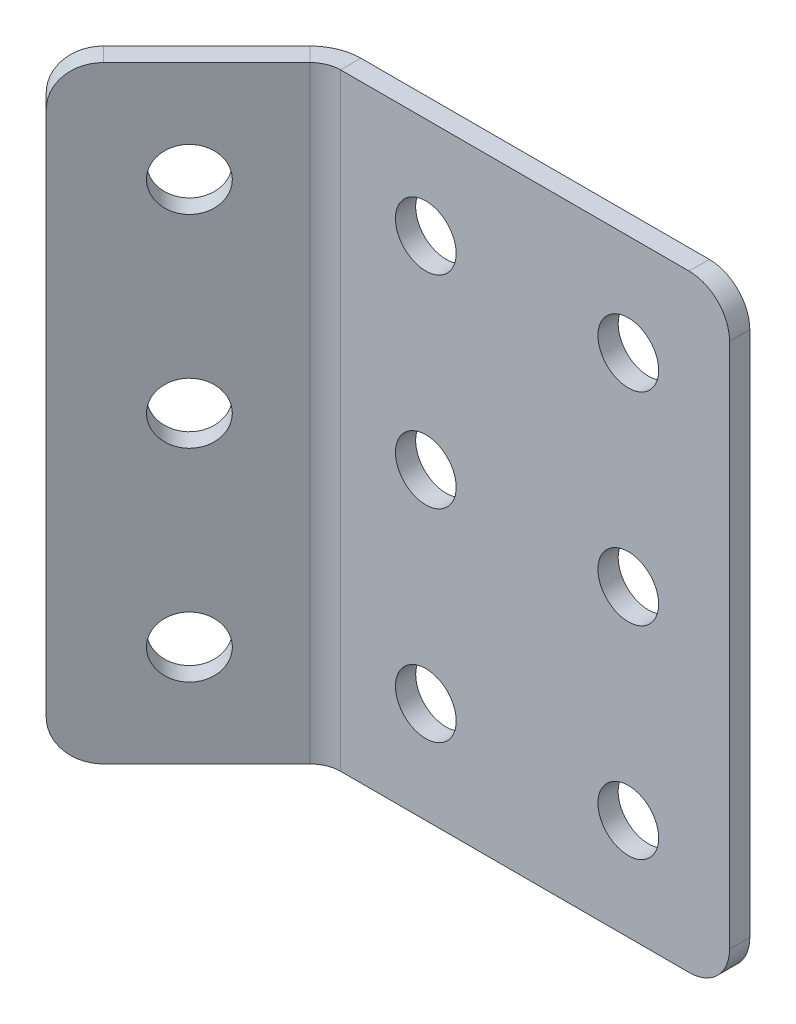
ISO-10303-21;
HEADER;
FILE_DESCRIPTION(('STEP AP214'),'2;1');
FILE_NAME('part.step','',(''),(''),'','','');
FILE_SCHEMA(('AUTOMOTIVE_DESIGN { 1 0 10303 214 1 1 1 1 }'));
ENDSEC;
DATA;
#1=APPLICATION_CONTEXT('core data for automotive mechanical design processes');
#2=APPLICATION_PROTOCOL_DEFINITION('international standard','automotive_design',2000,#1);
#3=PRODUCT_CONTEXT('',#1,'mechanical');
#4=PRODUCT('Part','Part','',(#3));
#5=PRODUCT_RELATED_PRODUCT_CATEGORY('part','',(#4));
#6=PRODUCT_DEFINITION_FORMATION('','',#4);
#7=PRODUCT_DEFINITION_CONTEXT('part definition',#1,'design');
#8=PRODUCT_DEFINITION('design','',#6,#7);
#9=PRODUCT_DEFINITION_SHAPE('','',#8);
#10=(LENGTH_UNIT() NAMED_UNIT(*) SI_UNIT(.MILLI.,.METRE.));
#11=(NAMED_UNIT(*) PLANE_ANGLE_UNIT() SI_UNIT($,.RADIAN.));
#12=(NAMED_UNIT(*) SI_UNIT($,.STERADIAN.) SOLID_ANGLE_UNIT());
#13=UNCERTAINTY_MEASURE_WITH_UNIT(LENGTH_MEASURE(1.E-05),#10,'distance_accuracy_value','');
#14=(GEOMETRIC_REPRESENTATION_CONTEXT(3) GLOBAL_UNCERTAINTY_ASSIGNED_CONTEXT((#13)) GLOBAL_UNIT_ASSIGNED_CONTEXT((#10,
#11,#12)) REPRESENTATION_CONTEXT('',''));
#15=CARTESIAN_POINT('',(0.,0.,0.));
#16=DIRECTION('',(0.,0.,1.));
#17=DIRECTION('',(1.,0.,0.));
#18=AXIS2_PLACEMENT_3D('',#15,#16,#17);
#19=CARTESIAN_POINT('',(-12.4987711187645,-15.,6.2482283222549));
#20=DIRECTION('',(0.,-1.,0.));
#21=DIRECTION('',(-0.707106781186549,0.,-0.707106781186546));
#22=AXIS2_PLACEMENT_3D('',#19,#20,#21);
#23=PLANE('',#22);
#24=DIRECTION('',(0.707106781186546,0.,-0.707106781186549));
#25=VECTOR('',#24,1.);
#26=CARTESIAN_POINT('',(-11.791664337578,-15.,6.95533510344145));
#27=LINE('',#26,#25);
#28=CARTESIAN_POINT('',(-10.3774507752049,-15.,5.54112154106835));
#29=VERTEX_POINT('',#28);
#30=CARTESIAN_POINT('',(-5.28121060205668,-15.,0.444881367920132));
#31=VERTEX_POINT('',#30);
#32=EDGE_CURVE('E198',#29,#31,#27,.T.);
#33=ORIENTED_EDGE('',*,*,#32,.F.);
#34=DIRECTION('',(0.707106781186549,0.,0.707106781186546));
#35=VECTOR('',#34,1.);
#36=CARTESIAN_POINT('',(-11.0845575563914,-15.,4.8340147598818));
#37=LINE('',#36,#35);
#38=CARTESIAN_POINT('',(-11.0845575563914,-15.,4.8340147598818));
#39=VERTEX_POINT('',#38);
#40=EDGE_CURVE('E247',#29,#39,#37,.F.);
#41=ORIENTED_EDGE('',*,*,#40,.T.);
#42=DIRECTION('',(0.707106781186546,0.,-0.707106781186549));
#43=VECTOR('',#42,1.);
#44=CARTESIAN_POINT('',(-12.4987711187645,-15.,6.2482283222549));
#45=LINE('',#44,#43);
#46=CARTESIAN_POINT('',(-5.98831738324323,-15.,-0.262225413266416));
#47=VERTEX_POINT('',#46);
#48=EDGE_CURVE('E174',#39,#47,#45,.T.);
#49=ORIENTED_EDGE('',*,*,#48,.T.);
#50=DIRECTION('',(0.707106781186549,0.,0.707106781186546));
#51=VECTOR('',#50,1.);
#52=CARTESIAN_POINT('',(-5.98831738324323,-15.,-0.262225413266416));
#53=LINE('',#52,#51);
#54=EDGE_CURVE('E211',#47,#31,#53,.T.);
#55=ORIENTED_EDGE('',*,*,#54,.T.);
#56=EDGE_LOOP('',(#33,#41,#49,#55));
#57=FACE_BOUND('',#56,.T.);
#58=ADVANCED_FACE('F46',(#57),#23,.T.);
#59=CARTESIAN_POINT('',(-12.4987711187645,15.,6.2482283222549));
#60=DIRECTION('',(0.,1.,0.));
#61=DIRECTION('',(0.707106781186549,0.,0.707106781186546));
#62=AXIS2_PLACEMENT_3D('',#59,#60,#61);
#63=PLANE('',#62);
#64=DIRECTION('',(-0.707106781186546,0.,0.707106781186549));
#65=VECTOR('',#64,1.);
#66=CARTESIAN_POINT('',(-12.4987711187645,15.,6.2482283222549));
#67=LINE('',#66,#65);
#68=CARTESIAN_POINT('',(-5.98831738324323,15.,-0.262225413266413));
#69=VERTEX_POINT('',#68);
#70=CARTESIAN_POINT('',(-11.0845575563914,15.,4.8340147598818));
#71=VERTEX_POINT('',#70);
#72=EDGE_CURVE('E188',#69,#71,#67,.T.);
#73=ORIENTED_EDGE('',*,*,#72,.T.);
#74=DIRECTION('',(0.707106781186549,0.,0.707106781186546));
#75=VECTOR('',#74,1.);
#76=CARTESIAN_POINT('',(-11.0845575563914,15.,4.8340147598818));
#77=LINE('',#76,#75);
#78=CARTESIAN_POINT('',(-10.3774507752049,15.,5.54112154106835));
#79=VERTEX_POINT('',#78);
#80=EDGE_CURVE('E218',#71,#79,#77,.T.);
#81=ORIENTED_EDGE('',*,*,#80,.T.);
#82=DIRECTION('',(-0.707106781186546,0.,0.707106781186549));
#83=VECTOR('',#82,1.);
#84=CARTESIAN_POINT('',(-11.791664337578,15.,6.95533510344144));
#85=LINE('',#84,#83);
#86=CARTESIAN_POINT('',(-5.28121060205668,15.,0.444881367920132));
#87=VERTEX_POINT('',#86);
#88=EDGE_CURVE('E203',#87,#79,#85,.T.);
#89=ORIENTED_EDGE('',*,*,#88,.F.);
#90=DIRECTION('',(-0.707106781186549,0.,-0.707106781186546));
#91=VECTOR('',#90,1.);
#92=CARTESIAN_POINT('',(-5.98831738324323,15.,-0.262225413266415));
#93=LINE('',#92,#91);
#94=EDGE_CURVE('E173',#87,#69,#93,.T.);
#95=ORIENTED_EDGE('',*,*,#94,.T.);
#96=EDGE_LOOP('',(#73,#81,#89,#95));
#97=FACE_BOUND('',#96,.T.);
#98=ADVANCED_FACE('F201',(#97),#63,.T.);
#99=CARTESIAN_POINT('',(-1.89216940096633,0.,-4.35837339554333));
#100=DIRECTION('',(-0.707106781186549,0.,-0.707106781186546));
#101=DIRECTION('',(-0.707106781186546,0.,0.707106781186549));
#102=AXIS2_PLACEMENT_3D('',#99,#100,#101);
#103=PLANE('',#102);
#104=CARTESIAN_POINT('',(-8.96323721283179,0.,2.71269441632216));
#105=DIRECTION('',(0.707106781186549,0.,0.707106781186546));
#106=DIRECTION('',(0.707106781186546,0.,-0.707106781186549));
#107=AXIS2_PLACEMENT_3D('',#104,#105,#106);
#108=CIRCLE('',#107,1.5);
#109=CARTESIAN_POINT('',(-7.90257704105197,0.,1.65203424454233));
#110=VERTEX_POINT('',#109);
#111=EDGE_CURVE('E225',#110,#110,#108,.T.);
#112=ORIENTED_EDGE('',*,*,#111,.T.);
#113=EDGE_LOOP('',(#112));
#114=FACE_BOUND('',#113,.T.);
#115=CARTESIAN_POINT('',(-8.9632372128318,9.99999999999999,2.71269441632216));
#116=DIRECTION('',(0.707106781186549,0.,0.707106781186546));
#117=DIRECTION('',(0.707106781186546,0.,-0.707106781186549));
#118=AXIS2_PLACEMENT_3D('',#115,#116,#117);
#119=CIRCLE('',#118,1.5);
#120=CARTESIAN_POINT('',(-7.90257704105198,9.99999999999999,1.65203424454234));
#121=VERTEX_POINT('',#120);
#122=EDGE_CURVE('E379',#121,#121,#119,.T.);
#123=ORIENTED_EDGE('',*,*,#122,.T.);
#124=EDGE_LOOP('',(#123));
#125=FACE_BOUND('',#124,.T.);
#126=CARTESIAN_POINT('',(-8.9632372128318,-10.,2.71269441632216));
#127=DIRECTION('',(0.707106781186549,0.,0.707106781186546));
#128=DIRECTION('',(-0.707106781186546,0.,0.707106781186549));
#129=AXIS2_PLACEMENT_3D('',#126,#127,#128);
#130=CIRCLE('',#129,1.5);
#131=CARTESIAN_POINT('',(-10.0238973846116,-10.,3.77335458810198));
#132=VERTEX_POINT('',#131);
#133=EDGE_CURVE('E371',#132,#132,#130,.T.);
#134=ORIENTED_EDGE('',*,*,#133,.T.);
#135=EDGE_LOOP('',(#134));
#136=FACE_BOUND('',#135,.T.);
#137=DIRECTION('',(0.,-1.,0.));
#138=VECTOR('',#137,1.);
#139=CARTESIAN_POINT('',(-12.4987711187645,-15.,6.2482283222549));
#140=LINE('',#139,#138);
#141=CARTESIAN_POINT('',(-12.4987711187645,13.,6.2482283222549));
#142=VERTEX_POINT('',#141);
#143=CARTESIAN_POINT('',(-12.4987711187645,-13.,6.2482283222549));
#144=VERTEX_POINT('',#143);
#145=EDGE_CURVE('E197',#142,#144,#140,.T.);
#146=ORIENTED_EDGE('',*,*,#145,.F.);
#147=CARTESIAN_POINT('',(-11.0845575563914,13.,4.8340147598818));
#148=DIRECTION('',(-0.707106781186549,0.,-0.707106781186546));
#149=DIRECTION('',(-0.707106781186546,0.,0.707106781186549));
#150=AXIS2_PLACEMENT_3D('',#147,#148,#149);
#151=CIRCLE('',#150,2.);
#152=EDGE_CURVE('E192',#142,#71,#151,.T.);
#153=ORIENTED_EDGE('',*,*,#152,.T.);
#154=ORIENTED_EDGE('',*,*,#72,.F.);
#155=DIRECTION('',(0.,-1.,0.));
#156=VECTOR('',#155,1.);
#157=CARTESIAN_POINT('',(-5.98831738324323,0.,-0.262225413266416));
#158=LINE('',#157,#156);
#159=EDGE_CURVE('E161',#69,#47,#158,.T.);
#160=ORIENTED_EDGE('',*,*,#159,.T.);
#161=ORIENTED_EDGE('',*,*,#48,.F.);
#162=CARTESIAN_POINT('',(-11.0845575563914,-13.,4.8340147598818));
#163=DIRECTION('',(-0.707106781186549,0.,-0.707106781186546));
#164=DIRECTION('',(-0.707106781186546,0.,0.707106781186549));
#165=AXIS2_PLACEMENT_3D('',#162,#163,#164);
#166=CIRCLE('',#165,2.);
#167=EDGE_CURVE('E242',#39,#144,#166,.T.);
#168=ORIENTED_EDGE('',*,*,#167,.T.);
#169=EDGE_LOOP('',(#146,#153,#154,#160,#161,#168));
#170=FACE_BOUND('',#169,.T.);
#171=ADVANCED_FACE('F190',(#114,#125,#136,#170),#103,.T.);
#172=CARTESIAN_POINT('',(-12.4987711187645,-15.,6.2482283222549));
#173=DIRECTION('',(-0.707106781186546,0.,0.707106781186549));
#174=DIRECTION('',(0.707106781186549,0.,0.707106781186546));
#175=AXIS2_PLACEMENT_3D('',#172,#173,#174);
#176=PLANE('',#175);
#177=DIRECTION('',(0.,-1.,0.));
#178=VECTOR('',#177,1.);
#179=CARTESIAN_POINT('',(-11.791664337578,-15.,6.95533510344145));
#180=LINE('',#179,#178);
#181=CARTESIAN_POINT('',(-11.791664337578,13.,6.95533510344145));
#182=VERTEX_POINT('',#181);
#183=CARTESIAN_POINT('',(-11.791664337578,-13.,6.95533510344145));
#184=VERTEX_POINT('',#183);
#185=EDGE_CURVE('E223',#182,#184,#180,.T.);
#186=ORIENTED_EDGE('',*,*,#185,.F.);
#187=DIRECTION('',(0.707106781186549,0.,0.707106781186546));
#188=VECTOR('',#187,1.);
#189=CARTESIAN_POINT('',(-12.4987711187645,13.,6.2482283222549));
#190=LINE('',#189,#188);
#191=EDGE_CURVE('E239',#182,#142,#190,.F.);
#192=ORIENTED_EDGE('',*,*,#191,.T.);
#193=ORIENTED_EDGE('',*,*,#145,.T.);
#194=DIRECTION('',(0.707106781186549,0.,0.707106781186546));
#195=VECTOR('',#194,1.);
#196=CARTESIAN_POINT('',(-12.4987711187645,-13.,6.2482283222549));
#197=LINE('',#196,#195);
#198=EDGE_CURVE('E235',#144,#184,#197,.T.);
#199=ORIENTED_EDGE('',*,*,#198,.T.);
#200=EDGE_LOOP('',(#186,#192,#193,#199));
#201=FACE_BOUND('',#200,.T.);
#202=ADVANCED_FACE('F404',(#201),#176,.T.);
#203=CARTESIAN_POINT('',(-1.18506261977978,0.,-3.65126661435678));
#204=DIRECTION('',(-0.707106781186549,0.,-0.707106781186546));
#205=DIRECTION('',(-0.707106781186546,0.,0.707106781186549));
#206=AXIS2_PLACEMENT_3D('',#203,#204,#205);
#207=PLANE('',#206);
#208=ORIENTED_EDGE('',*,*,#88,.T.);
#209=CARTESIAN_POINT('',(-10.3774507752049,13.,5.54112154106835));
#210=DIRECTION('',(-0.707106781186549,0.,-0.707106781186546));
#211=DIRECTION('',(-0.707106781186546,0.,0.707106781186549));
#212=AXIS2_PLACEMENT_3D('',#209,#210,#211);
#213=CIRCLE('',#212,2.);
#214=EDGE_CURVE('E232',#79,#182,#213,.F.);
#215=ORIENTED_EDGE('',*,*,#214,.T.);
#216=ORIENTED_EDGE('',*,*,#185,.T.);
#217=CARTESIAN_POINT('',(-10.3774507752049,-13.,5.54112154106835));
#218=DIRECTION('',(-0.707106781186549,0.,-0.707106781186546));
#219=DIRECTION('',(-0.707106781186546,0.,0.707106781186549));
#220=AXIS2_PLACEMENT_3D('',#217,#218,#219);
#221=CIRCLE('',#220,2.);
#222=EDGE_CURVE('E229',#184,#29,#221,.F.);
#223=ORIENTED_EDGE('',*,*,#222,.T.);
#224=ORIENTED_EDGE('',*,*,#32,.T.);
#225=DIRECTION('',(0.,-1.,0.));
#226=VECTOR('',#225,1.);
#227=CARTESIAN_POINT('',(-5.28121060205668,0.,0.44488136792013));
#228=LINE('',#227,#226);
#229=EDGE_CURVE('E206',#87,#31,#228,.T.);
#230=ORIENTED_EDGE('',*,*,#229,.F.);
#231=EDGE_LOOP('',(#208,#215,#216,#223,#224,#230));
#232=FACE_BOUND('',#231,.T.);
#233=CARTESIAN_POINT('',(-8.25613043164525,-10.,3.41980119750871));
#234=DIRECTION('',(0.707106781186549,0.,0.707106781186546));
#235=DIRECTION('',(-0.707106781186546,0.,0.707106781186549));
#236=AXIS2_PLACEMENT_3D('',#233,#234,#235);
#237=CIRCLE('',#236,1.5);
#238=CARTESIAN_POINT('',(-9.31679060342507,-10.,4.48046136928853));
#239=VERTEX_POINT('',#238);
#240=EDGE_CURVE('E287',#239,#239,#237,.T.);
#241=ORIENTED_EDGE('',*,*,#240,.F.);
#242=EDGE_LOOP('',(#241));
#243=FACE_BOUND('',#242,.T.);
#244=CARTESIAN_POINT('',(-8.25613043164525,9.99999999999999,3.4198011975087));
#245=DIRECTION('',(0.707106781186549,0.,0.707106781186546));
#246=DIRECTION('',(0.707106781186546,0.,-0.707106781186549));
#247=AXIS2_PLACEMENT_3D('',#244,#245,#246);
#248=CIRCLE('',#247,1.5);
#249=CARTESIAN_POINT('',(-7.19547025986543,9.99999999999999,2.35914102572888));
#250=VERTEX_POINT('',#249);
#251=EDGE_CURVE('E375',#250,#250,#248,.T.);
#252=ORIENTED_EDGE('',*,*,#251,.F.);
#253=EDGE_LOOP('',(#252));
#254=FACE_BOUND('',#253,.T.);
#255=CARTESIAN_POINT('',(-8.25613043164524,0.,3.4198011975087));
#256=DIRECTION('',(0.707106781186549,0.,0.707106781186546));
#257=DIRECTION('',(0.707106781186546,0.,-0.707106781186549));
#258=AXIS2_PLACEMENT_3D('',#255,#256,#257);
#259=CIRCLE('',#258,1.5);
#260=CARTESIAN_POINT('',(-7.19547025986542,0.,2.35914102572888));
#261=VERTEX_POINT('',#260);
#262=EDGE_CURVE('E383',#261,#261,#259,.T.);
#263=ORIENTED_EDGE('',*,*,#262,.F.);
#264=EDGE_LOOP('',(#263));
#265=FACE_BOUND('',#264,.T.);
#266=ADVANCED_FACE('F399',(#232,#243,#254,#265),#207,.F.);
#267=CARTESIAN_POINT('',(-8.96323721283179,0.,2.71269441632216));
#268=DIRECTION('',(0.707106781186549,0.,0.707106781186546));
#269=DIRECTION('',(0.707106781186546,0.,-0.707106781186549));
#270=AXIS2_PLACEMENT_3D('',#267,#268,#269);
#271=CYLINDRICAL_SURFACE('',#270,1.5);
#272=ORIENTED_EDGE('',*,*,#111,.F.);
#273=EDGE_LOOP('',(#272));
#274=FACE_BOUND('',#273,.T.);
#275=ORIENTED_EDGE('',*,*,#262,.T.);
#276=EDGE_LOOP('',(#275));
#277=FACE_BOUND('',#276,.T.);
#278=ADVANCED_FACE('F437',(#274,#277),#271,.F.);
#279=CARTESIAN_POINT('',(-8.9632372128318,9.99999999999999,2.71269441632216));
#280=DIRECTION('',(0.707106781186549,0.,0.707106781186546));
#281=DIRECTION('',(0.707106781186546,0.,-0.707106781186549));
#282=AXIS2_PLACEMENT_3D('',#279,#280,#281);
#283=CYLINDRICAL_SURFACE('',#282,1.5);
#284=ORIENTED_EDGE('',*,*,#122,.F.);
#285=EDGE_LOOP('',(#284));
#286=FACE_BOUND('',#285,.T.);
#287=ORIENTED_EDGE('',*,*,#251,.T.);
#288=EDGE_LOOP('',(#287));
#289=FACE_BOUND('',#288,.T.);
#290=ADVANCED_FACE('F446',(#286,#289),#283,.F.);
#291=CARTESIAN_POINT('',(-8.9632372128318,-10.,2.71269441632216));
#292=DIRECTION('',(0.707106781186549,0.,0.707106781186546));
#293=DIRECTION('',(0.707106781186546,0.,-0.707106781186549));
#294=AXIS2_PLACEMENT_3D('',#291,#292,#293);
#295=CYLINDRICAL_SURFACE('',#294,1.5);
#296=ORIENTED_EDGE('',*,*,#133,.F.);
#297=EDGE_LOOP('',(#296));
#298=FACE_BOUND('',#297,.T.);
#299=ORIENTED_EDGE('',*,*,#240,.T.);
#300=EDGE_LOOP('',(#299));
#301=FACE_BOUND('',#300,.T.);
#302=ADVANCED_FACE('F450',(#298,#301),#295,.F.);
#303=CARTESIAN_POINT('',(0.,-9.99999999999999,-1.));
#304=DIRECTION('',(0.,0.,1.));
#305=DIRECTION('',(1.,0.,0.));
#306=AXIS2_PLACEMENT_3D('',#303,#304,#305);
#307=CYLINDRICAL_SURFACE('',#306,1.5);
#308=CARTESIAN_POINT('',(0.,-9.99999999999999,-1.));
#309=DIRECTION('',(0.,0.,1.));
#310=DIRECTION('',(-1.,0.,0.));
#311=AXIS2_PLACEMENT_3D('',#308,#309,#310);
#312=CIRCLE('',#311,1.5);
#313=CARTESIAN_POINT('',(-1.5,-9.99999999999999,-1.));
#314=VERTEX_POINT('',#313);
#315=EDGE_CURVE('E315',#314,#314,#312,.T.);
#316=ORIENTED_EDGE('',*,*,#315,.F.);
#317=EDGE_LOOP('',(#316));
#318=FACE_BOUND('',#317,.T.);
#319=CARTESIAN_POINT('',(0.,-9.99999999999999,0.));
#320=DIRECTION('',(0.,0.,1.));
#321=DIRECTION('',(-1.,0.,0.));
#322=AXIS2_PLACEMENT_3D('',#319,#320,#321);
#323=CIRCLE('',#322,1.5);
#324=CARTESIAN_POINT('',(-1.5,-9.99999999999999,0.));
#325=VERTEX_POINT('',#324);
#326=EDGE_CURVE('E360',#325,#325,#323,.T.);
#327=ORIENTED_EDGE('',*,*,#326,.T.);
#328=EDGE_LOOP('',(#327));
#329=FACE_BOUND('',#328,.T.);
#330=ADVANCED_FACE('F454',(#318,#329),#307,.F.);
#331=CARTESIAN_POINT('',(0.,0.,-1.));
#332=DIRECTION('',(0.,0.,1.));
#333=DIRECTION('',(1.,0.,0.));
#334=AXIS2_PLACEMENT_3D('',#331,#332,#333);
#335=CYLINDRICAL_SURFACE('',#334,1.5);
#336=CARTESIAN_POINT('',(0.,0.,-1.));
#337=DIRECTION('',(0.,0.,1.));
#338=DIRECTION('',(1.,0.,0.));
#339=AXIS2_PLACEMENT_3D('',#336,#337,#338);
#340=CIRCLE('',#339,1.5);
#341=CARTESIAN_POINT('',(1.5,0.,-1.));
#342=VERTEX_POINT('',#341);
#343=EDGE_CURVE('E319',#342,#342,#340,.T.);
#344=ORIENTED_EDGE('',*,*,#343,.F.);
#345=EDGE_LOOP('',(#344));
#346=FACE_BOUND('',#345,.T.);
#347=CARTESIAN_POINT('',(0.,0.,0.));
#348=DIRECTION('',(0.,0.,1.));
#349=DIRECTION('',(1.,0.,0.));
#350=AXIS2_PLACEMENT_3D('',#347,#348,#349);
#351=CIRCLE('',#350,1.5);
#352=CARTESIAN_POINT('',(1.5,0.,0.));
#353=VERTEX_POINT('',#352);
#354=EDGE_CURVE('E356',#353,#353,#351,.T.);
#355=ORIENTED_EDGE('',*,*,#354,.T.);
#356=EDGE_LOOP('',(#355));
#357=FACE_BOUND('',#356,.T.);
#358=ADVANCED_FACE('F483',(#346,#357),#335,.F.);
#359=CARTESIAN_POINT('',(0.,9.99999999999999,-1.));
#360=DIRECTION('',(0.,0.,1.));
#361=DIRECTION('',(1.,0.,0.));
#362=AXIS2_PLACEMENT_3D('',#359,#360,#361);
#363=CYLINDRICAL_SURFACE('',#362,1.5);
#364=CARTESIAN_POINT('',(0.,9.99999999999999,-1.));
#365=DIRECTION('',(0.,0.,1.));
#366=DIRECTION('',(1.,0.,0.));
#367=AXIS2_PLACEMENT_3D('',#364,#365,#366);
#368=CIRCLE('',#367,1.5);
#369=CARTESIAN_POINT('',(1.5,9.99999999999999,-1.));
#370=VERTEX_POINT('',#369);
#371=EDGE_CURVE('E323',#370,#370,#368,.T.);
#372=ORIENTED_EDGE('',*,*,#371,.F.);
#373=EDGE_LOOP('',(#372));
#374=FACE_BOUND('',#373,.T.);
#375=CARTESIAN_POINT('',(0.,9.99999999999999,0.));
#376=DIRECTION('',(0.,0.,1.));
#377=DIRECTION('',(1.,0.,0.));
#378=AXIS2_PLACEMENT_3D('',#375,#376,#377);
#379=CIRCLE('',#378,1.5);
#380=CARTESIAN_POINT('',(1.5,9.99999999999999,0.));
#381=VERTEX_POINT('',#380);
#382=EDGE_CURVE('E352',#381,#381,#379,.T.);
#383=ORIENTED_EDGE('',*,*,#382,.T.);
#384=EDGE_LOOP('',(#383));
#385=FACE_BOUND('',#384,.T.);
#386=ADVANCED_FACE('F479',(#374,#385),#363,.F.);
#387=CARTESIAN_POINT('',(10.,-10.,-1.));
#388=DIRECTION('',(0.,0.,1.));
#389=DIRECTION('',(1.,0.,0.));
#390=AXIS2_PLACEMENT_3D('',#387,#388,#389);
#391=CYLINDRICAL_SURFACE('',#390,1.5);
#392=CARTESIAN_POINT('',(10.,-10.,-1.));
#393=DIRECTION('',(0.,0.,1.));
#394=DIRECTION('',(1.,0.,0.));
#395=AXIS2_PLACEMENT_3D('',#392,#393,#394);
#396=CIRCLE('',#395,1.5);
#397=CARTESIAN_POINT('',(11.5,-10.,-1.));
#398=VERTEX_POINT('',#397);
#399=EDGE_CURVE('E327',#398,#398,#396,.T.);
#400=ORIENTED_EDGE('',*,*,#399,.F.);
#401=EDGE_LOOP('',(#400));
#402=FACE_BOUND('',#401,.T.);
#403=CARTESIAN_POINT('',(10.,-10.,0.));
#404=DIRECTION('',(0.,0.,1.));
#405=DIRECTION('',(1.,0.,0.));
#406=AXIS2_PLACEMENT_3D('',#403,#404,#405);
#407=CIRCLE('',#406,1.5);
#408=CARTESIAN_POINT('',(11.5,-10.,0.));
#409=VERTEX_POINT('',#408);
#410=EDGE_CURVE('E348',#409,#409,#407,.T.);
#411=ORIENTED_EDGE('',*,*,#410,.T.);
#412=EDGE_LOOP('',(#411));
#413=FACE_BOUND('',#412,.T.);
#414=ADVANCED_FACE('F475',(#402,#413),#391,.F.);
#415=CARTESIAN_POINT('',(10.,0.,-1.));
#416=DIRECTION('',(0.,0.,1.));
#417=DIRECTION('',(1.,0.,0.));
#418=AXIS2_PLACEMENT_3D('',#415,#416,#417);
#419=CYLINDRICAL_SURFACE('',#418,1.5);
#420=CARTESIAN_POINT('',(10.,0.,-1.));
#421=DIRECTION('',(0.,0.,1.));
#422=DIRECTION('',(-1.,0.,0.));
#423=AXIS2_PLACEMENT_3D('',#420,#421,#422);
#424=CIRCLE('',#423,1.5);
#425=CARTESIAN_POINT('',(8.5,0.,-1.));
#426=VERTEX_POINT('',#425);
#427=EDGE_CURVE('E331',#426,#426,#424,.T.);
#428=ORIENTED_EDGE('',*,*,#427,.F.);
#429=EDGE_LOOP('',(#428));
#430=FACE_BOUND('',#429,.T.);
#431=CARTESIAN_POINT('',(10.,0.,0.));
#432=DIRECTION('',(0.,0.,1.));
#433=DIRECTION('',(-1.,0.,0.));
#434=AXIS2_PLACEMENT_3D('',#431,#432,#433);
#435=CIRCLE('',#434,1.5);
#436=CARTESIAN_POINT('',(8.5,0.,0.));
#437=VERTEX_POINT('',#436);
#438=EDGE_CURVE('E344',#437,#437,#435,.T.);
#439=ORIENTED_EDGE('',*,*,#438,.T.);
#440=EDGE_LOOP('',(#439));
#441=FACE_BOUND('',#440,.T.);
#442=ADVANCED_FACE('F471',(#430,#441),#419,.F.);
#443=CARTESIAN_POINT('',(10.,10.,-1.));
#444=DIRECTION('',(0.,0.,1.));
#445=DIRECTION('',(1.,0.,0.));
#446=AXIS2_PLACEMENT_3D('',#443,#444,#445);
#447=CYLINDRICAL_SURFACE('',#446,1.5);
#448=CARTESIAN_POINT('',(10.,10.,-1.));
#449=DIRECTION('',(0.,0.,1.));
#450=DIRECTION('',(-1.,0.,0.));
#451=AXIS2_PLACEMENT_3D('',#448,#449,#450);
#452=CIRCLE('',#451,1.5);
#453=CARTESIAN_POINT('',(8.5,10.,-1.));
#454=VERTEX_POINT('',#453);
#455=EDGE_CURVE('E335',#454,#454,#452,.T.);
#456=ORIENTED_EDGE('',*,*,#455,.F.);
#457=EDGE_LOOP('',(#456));
#458=FACE_BOUND('',#457,.T.);
#459=CARTESIAN_POINT('',(10.,10.,0.));
#460=DIRECTION('',(0.,0.,1.));
#461=DIRECTION('',(-1.,0.,0.));
#462=AXIS2_PLACEMENT_3D('',#459,#460,#461);
#463=CIRCLE('',#462,1.5);
#464=CARTESIAN_POINT('',(8.5,10.,0.));
#465=VERTEX_POINT('',#464);
#466=EDGE_CURVE('E340',#465,#465,#463,.T.);
#467=ORIENTED_EDGE('',*,*,#466,.T.);
#468=EDGE_LOOP('',(#467));
#469=FACE_BOUND('',#468,.T.);
#470=ADVANCED_FACE('F468',(#458,#469),#447,.F.);
#471=CARTESIAN_POINT('',(15.,-15.,-1.));
#472=DIRECTION('',(1.,0.,0.));
#473=DIRECTION('',(0.,0.,-1.));
#474=AXIS2_PLACEMENT_3D('',#471,#472,#473);
#475=PLANE('',#474);
#476=DIRECTION('',(0.,1.,0.));
#477=VECTOR('',#476,1.);
#478=CARTESIAN_POINT('',(15.,-15.,0.));
#479=LINE('',#478,#477);
#480=CARTESIAN_POINT('',(15.,-13.,0.));
#481=VERTEX_POINT('',#480);
#482=CARTESIAN_POINT('',(15.,13.,0.));
#483=VERTEX_POINT('',#482);
#484=EDGE_CURVE('E288',#481,#483,#479,.T.);
#485=ORIENTED_EDGE('',*,*,#484,.F.);
#486=DIRECTION('',(0.,0.,1.));
#487=VECTOR('',#486,1.);
#488=CARTESIAN_POINT('',(15.,-13.,-1.));
#489=LINE('',#488,#487);
#490=CARTESIAN_POINT('',(15.,-13.,-1.));
#491=VERTEX_POINT('',#490);
#492=EDGE_CURVE('E264',#481,#491,#489,.F.);
#493=ORIENTED_EDGE('',*,*,#492,.T.);
#494=DIRECTION('',(0.,1.,0.));
#495=VECTOR('',#494,1.);
#496=CARTESIAN_POINT('',(15.,-15.,-1.));
#497=LINE('',#496,#495);
#498=CARTESIAN_POINT('',(15.,13.,-1.));
#499=VERTEX_POINT('',#498);
#500=EDGE_CURVE('E277',#491,#499,#497,.T.);
#501=ORIENTED_EDGE('',*,*,#500,.T.);
#502=DIRECTION('',(0.,0.,1.));
#503=VECTOR('',#502,1.);
#504=CARTESIAN_POINT('',(15.,13.,-1.));
#505=LINE('',#504,#503);
#506=EDGE_CURVE('E260',#499,#483,#505,.T.);
#507=ORIENTED_EDGE('',*,*,#506,.T.);
#508=EDGE_LOOP('',(#485,#493,#501,#507));
#509=FACE_BOUND('',#508,.T.);
#510=ADVANCED_FACE('F298',(#509),#475,.T.);
#511=CARTESIAN_POINT('',(0.,0.,-1.));
#512=DIRECTION('',(0.,0.,-1.));
#513=DIRECTION('',(-1.,0.,0.));
#514=AXIS2_PLACEMENT_3D('',#511,#512,#513);
#515=PLANE('',#514);
#516=ORIENTED_EDGE('',*,*,#500,.F.);
#517=CARTESIAN_POINT('',(13.,-13.,-1.));
#518=DIRECTION('',(0.,0.,-1.));
#519=DIRECTION('',(-1.,0.,0.));
#520=AXIS2_PLACEMENT_3D('',#517,#518,#519);
#521=CIRCLE('',#520,2.);
#522=CARTESIAN_POINT('',(13.,-15.,-1.));
#523=VERTEX_POINT('',#522);
#524=EDGE_CURVE('E55',#491,#523,#521,.T.);
#525=ORIENTED_EDGE('',*,*,#524,.T.);
#526=DIRECTION('',(1.,0.,0.));
#527=VECTOR('',#526,1.);
#528=CARTESIAN_POINT('',(-15.,-15.,-1.));
#529=LINE('',#528,#527);
#530=CARTESIAN_POINT('',(-4.20717196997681,-15.,-1.));
#531=VERTEX_POINT('',#530);
#532=EDGE_CURVE('E275',#531,#523,#529,.T.);
#533=ORIENTED_EDGE('',*,*,#532,.F.);
#534=DIRECTION('',(0.,-1.,0.));
#535=VECTOR('',#534,1.);
#536=CARTESIAN_POINT('',(-4.20717196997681,0.,-1.));
#537=LINE('',#536,#535);
#538=CARTESIAN_POINT('',(-4.20717196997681,15.,-1.));
#539=VERTEX_POINT('',#538);
#540=EDGE_CURVE('E368',#539,#531,#537,.T.);
#541=ORIENTED_EDGE('',*,*,#540,.F.);
#542=DIRECTION('',(-1.,0.,0.));
#543=VECTOR('',#542,1.);
#544=CARTESIAN_POINT('',(-15.,15.,-1.));
#545=LINE('',#544,#543);
#546=CARTESIAN_POINT('',(13.,15.,-1.));
#547=VERTEX_POINT('',#546);
#548=EDGE_CURVE('E312',#547,#539,#545,.T.);
#549=ORIENTED_EDGE('',*,*,#548,.F.);
#550=CARTESIAN_POINT('',(13.,13.,-1.));
#551=DIRECTION('',(0.,0.,-1.));
#552=DIRECTION('',(-1.,0.,0.));
#553=AXIS2_PLACEMENT_3D('',#550,#551,#552);
#554=CIRCLE('',#553,2.);
#555=EDGE_CURVE('E72',#547,#499,#554,.T.);
#556=ORIENTED_EDGE('',*,*,#555,.T.);
#557=EDGE_LOOP('',(#516,#525,#533,#541,#549,#556));
#558=FACE_BOUND('',#557,.T.);
#559=ORIENTED_EDGE('',*,*,#455,.T.);
#560=EDGE_LOOP('',(#559));
#561=FACE_BOUND('',#560,.T.);
#562=ORIENTED_EDGE('',*,*,#427,.T.);
#563=EDGE_LOOP('',(#562));
#564=FACE_BOUND('',#563,.T.);
#565=ORIENTED_EDGE('',*,*,#399,.T.);
#566=EDGE_LOOP('',(#565));
#567=FACE_BOUND('',#566,.T.);
#568=ORIENTED_EDGE('',*,*,#371,.T.);
#569=EDGE_LOOP('',(#568));
#570=FACE_BOUND('',#569,.T.);
#571=ORIENTED_EDGE('',*,*,#343,.T.);
#572=EDGE_LOOP('',(#571));
#573=FACE_BOUND('',#572,.T.);
#574=ORIENTED_EDGE('',*,*,#315,.T.);
#575=EDGE_LOOP('',(#574));
#576=FACE_BOUND('',#575,.T.);
#577=ADVANCED_FACE('F272',(#558,#561,#564,#567,#570,#573,#576),#515,.T.);
#578=CARTESIAN_POINT('',(-15.,15.,-1.));
#579=DIRECTION('',(0.,1.,0.));
#580=DIRECTION('',(0.,0.,1.));
#581=AXIS2_PLACEMENT_3D('',#578,#579,#580);
#582=PLANE('',#581);
#583=DIRECTION('',(-1.,0.,0.));
#584=VECTOR('',#583,1.);
#585=CARTESIAN_POINT('',(-15.,15.,0.));
#586=LINE('',#585,#584);
#587=CARTESIAN_POINT('',(13.,15.,0.));
#588=VERTEX_POINT('',#587);
#589=CARTESIAN_POINT('',(-4.20717196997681,15.,0.));
#590=VERTEX_POINT('',#589);
#591=EDGE_CURVE('E309',#588,#590,#586,.T.);
#592=ORIENTED_EDGE('',*,*,#591,.F.);
#593=DIRECTION('',(0.,0.,1.));
#594=VECTOR('',#593,1.);
#595=CARTESIAN_POINT('',(13.,15.,-1.));
#596=LINE('',#595,#594);
#597=EDGE_CURVE('E12',#588,#547,#596,.F.);
#598=ORIENTED_EDGE('',*,*,#597,.T.);
#599=ORIENTED_EDGE('',*,*,#548,.T.);
#600=DIRECTION('',(0.,0.,-1.));
#601=VECTOR('',#600,1.);
#602=CARTESIAN_POINT('',(-4.20717196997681,15.,-1.));
#603=LINE('',#602,#601);
#604=EDGE_CURVE('E183',#590,#539,#603,.T.);
#605=ORIENTED_EDGE('',*,*,#604,.F.);
#606=EDGE_LOOP('',(#592,#598,#599,#605));
#607=FACE_BOUND('',#606,.T.);
#608=ADVANCED_FACE('F460',(#607),#582,.T.);
#609=CARTESIAN_POINT('',(0.,0.,0.));
#610=DIRECTION('',(0.,0.,-1.));
#611=DIRECTION('',(-1.,0.,0.));
#612=AXIS2_PLACEMENT_3D('',#609,#610,#611);
#613=PLANE('',#612);
#614=ORIENTED_EDGE('',*,*,#326,.F.);
#615=EDGE_LOOP('',(#614));
#616=FACE_BOUND('',#615,.T.);
#617=ORIENTED_EDGE('',*,*,#354,.F.);
#618=EDGE_LOOP('',(#617));
#619=FACE_BOUND('',#618,.T.);
#620=ORIENTED_EDGE('',*,*,#382,.F.);
#621=EDGE_LOOP('',(#620));
#622=FACE_BOUND('',#621,.T.);
#623=ORIENTED_EDGE('',*,*,#410,.F.);
#624=EDGE_LOOP('',(#623));
#625=FACE_BOUND('',#624,.T.);
#626=ORIENTED_EDGE('',*,*,#438,.F.);
#627=EDGE_LOOP('',(#626));
#628=FACE_BOUND('',#627,.T.);
#629=ORIENTED_EDGE('',*,*,#466,.F.);
#630=EDGE_LOOP('',(#629));
#631=FACE_BOUND('',#630,.T.);
#632=DIRECTION('',(1.,0.,0.));
#633=VECTOR('',#632,1.);
#634=CARTESIAN_POINT('',(-15.,-15.,0.));
#635=LINE('',#634,#633);
#636=CARTESIAN_POINT('',(-4.20717196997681,-15.,0.));
#637=VERTEX_POINT('',#636);
#638=CARTESIAN_POINT('',(13.,-15.,0.));
#639=VERTEX_POINT('',#638);
#640=EDGE_CURVE('E296',#637,#639,#635,.T.);
#641=ORIENTED_EDGE('',*,*,#640,.T.);
#642=CARTESIAN_POINT('',(13.,-13.,0.));
#643=DIRECTION('',(0.,0.,-1.));
#644=DIRECTION('',(-1.,0.,0.));
#645=AXIS2_PLACEMENT_3D('',#642,#643,#644);
#646=CIRCLE('',#645,2.);
#647=EDGE_CURVE('E257',#639,#481,#646,.F.);
#648=ORIENTED_EDGE('',*,*,#647,.T.);
#649=ORIENTED_EDGE('',*,*,#484,.T.);
#650=CARTESIAN_POINT('',(13.,13.,0.));
#651=DIRECTION('',(0.,0.,-1.));
#652=DIRECTION('',(-1.,0.,0.));
#653=AXIS2_PLACEMENT_3D('',#650,#651,#652);
#654=CIRCLE('',#653,2.);
#655=EDGE_CURVE('E254',#483,#588,#654,.F.);
#656=ORIENTED_EDGE('',*,*,#655,.T.);
#657=ORIENTED_EDGE('',*,*,#591,.T.);
#658=DIRECTION('',(0.,-1.,0.));
#659=VECTOR('',#658,1.);
#660=CARTESIAN_POINT('',(-4.20717196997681,0.,0.));
#661=LINE('',#660,#659);
#662=EDGE_CURVE('E303',#590,#637,#661,.T.);
#663=ORIENTED_EDGE('',*,*,#662,.T.);
#664=EDGE_LOOP('',(#641,#648,#649,#656,#657,#663));
#665=FACE_BOUND('',#664,.T.);
#666=ADVANCED_FACE('F294',(#616,#619,#622,#625,#628,#631,#665),#613,.F.);
#667=CARTESIAN_POINT('',(-15.,-15.,-1.));
#668=DIRECTION('',(0.,-1.,0.));
#669=DIRECTION('',(0.,0.,-1.));
#670=AXIS2_PLACEMENT_3D('',#667,#668,#669);
#671=PLANE('',#670);
#672=ORIENTED_EDGE('',*,*,#532,.T.);
#673=DIRECTION('',(0.,0.,1.));
#674=VECTOR('',#673,1.);
#675=CARTESIAN_POINT('',(13.,-15.,-1.));
#676=LINE('',#675,#674);
#677=EDGE_CURVE('E250',#523,#639,#676,.T.);
#678=ORIENTED_EDGE('',*,*,#677,.T.);
#679=ORIENTED_EDGE('',*,*,#640,.F.);
#680=DIRECTION('',(0.,0.,1.));
#681=VECTOR('',#680,1.);
#682=CARTESIAN_POINT('',(-4.20717196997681,-15.,-1.));
#683=LINE('',#682,#681);
#684=EDGE_CURVE('E285',#531,#637,#683,.T.);
#685=ORIENTED_EDGE('',*,*,#684,.F.);
#686=EDGE_LOOP('',(#672,#678,#679,#685));
#687=FACE_BOUND('',#686,.T.);
#688=ADVANCED_FACE('F282',(#687),#671,.T.);
#689=CARTESIAN_POINT('',(-4.20717196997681,15.,1.51892));
#690=DIRECTION('',(0.,1.,0.));
#691=DIRECTION('',(0.,0.,1.));
#692=AXIS2_PLACEMENT_3D('',#689,#690,#691);
#693=PLANE('',#692);
#694=ORIENTED_EDGE('',*,*,#94,.F.);
#695=CARTESIAN_POINT('',(-4.20717196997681,15.,1.51892));
#696=DIRECTION('',(0.,1.,0.));
#697=DIRECTION('',(-1.,0.,0.));
#698=AXIS2_PLACEMENT_3D('',#695,#696,#697);
#699=CIRCLE('',#698,1.51892);
#700=EDGE_CURVE('E413',#87,#590,#699,.F.);
#701=ORIENTED_EDGE('',*,*,#700,.T.);
#702=ORIENTED_EDGE('',*,*,#604,.T.);
#703=CARTESIAN_POINT('',(-4.20717196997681,15.,1.51892));
#704=DIRECTION('',(0.,-1.,0.));
#705=DIRECTION('',(0.,0.,1.));
#706=AXIS2_PLACEMENT_3D('',#703,#704,#705);
#707=CIRCLE('',#706,2.51892);
#708=EDGE_CURVE('E165',#69,#539,#707,.T.);
#709=ORIENTED_EDGE('',*,*,#708,.F.);
#710=EDGE_LOOP('',(#694,#701,#702,#709));
#711=FACE_BOUND('',#710,.T.);
#712=ADVANCED_FACE('F178',(#711),#693,.T.);
#713=CARTESIAN_POINT('',(-4.20717196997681,-15.,1.51892));
#714=DIRECTION('',(0.,-1.,0.));
#715=DIRECTION('',(0.,0.,-1.));
#716=AXIS2_PLACEMENT_3D('',#713,#714,#715);
#717=PLANE('',#716);
#718=CARTESIAN_POINT('',(-4.20717196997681,-15.,1.51892));
#719=DIRECTION('',(0.,1.,0.));
#720=DIRECTION('',(-1.,0.,0.));
#721=AXIS2_PLACEMENT_3D('',#718,#719,#720);
#722=CIRCLE('',#721,1.51892);
#723=EDGE_CURVE('E185',#637,#31,#722,.T.);
#724=ORIENTED_EDGE('',*,*,#723,.T.);
#725=ORIENTED_EDGE('',*,*,#54,.F.);
#726=CARTESIAN_POINT('',(-4.20717196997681,-15.,1.51892));
#727=DIRECTION('',(0.,1.,0.));
#728=DIRECTION('',(0.,0.,-1.));
#729=AXIS2_PLACEMENT_3D('',#726,#727,#728);
#730=CIRCLE('',#729,2.51892);
#731=EDGE_CURVE('E167',#531,#47,#730,.T.);
#732=ORIENTED_EDGE('',*,*,#731,.F.);
#733=ORIENTED_EDGE('',*,*,#684,.T.);
#734=EDGE_LOOP('',(#724,#725,#732,#733));
#735=FACE_BOUND('',#734,.T.);
#736=ADVANCED_FACE('F415',(#735),#717,.T.);
#737=CARTESIAN_POINT('',(-4.20717196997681,-30.0585146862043,1.51892));
#738=DIRECTION('',(0.,1.,0.));
#739=DIRECTION('',(-1.,0.,0.));
#740=AXIS2_PLACEMENT_3D('',#737,#738,#739);
#741=CYLINDRICAL_SURFACE('',#740,2.51892);
#742=ORIENTED_EDGE('',*,*,#540,.T.);
#743=ORIENTED_EDGE('',*,*,#731,.T.);
#744=ORIENTED_EDGE('',*,*,#159,.F.);
#745=ORIENTED_EDGE('',*,*,#708,.T.);
#746=EDGE_LOOP('',(#742,#743,#744,#745));
#747=FACE_BOUND('',#746,.T.);
#748=ADVANCED_FACE('F164',(#747),#741,.T.);
#749=CARTESIAN_POINT('',(-4.20717196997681,-30.0585146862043,1.51892));
#750=DIRECTION('',(0.,1.,0.));
#751=DIRECTION('',(-1.,0.,0.));
#752=AXIS2_PLACEMENT_3D('',#749,#750,#751);
#753=CYLINDRICAL_SURFACE('',#752,1.51892);
#754=ORIENTED_EDGE('',*,*,#662,.F.);
#755=ORIENTED_EDGE('',*,*,#700,.F.);
#756=ORIENTED_EDGE('',*,*,#229,.T.);
#757=ORIENTED_EDGE('',*,*,#723,.F.);
#758=EDGE_LOOP('',(#754,#755,#756,#757));
#759=FACE_BOUND('',#758,.T.);
#760=ADVANCED_FACE('F412',(#759),#753,.F.);
#761=CARTESIAN_POINT('',(-11.0845575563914,13.,4.8340147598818));
#762=DIRECTION('',(0.707106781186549,0.,0.707106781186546));
#763=DIRECTION('',(0.707106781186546,0.,-0.707106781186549));
#764=AXIS2_PLACEMENT_3D('',#761,#762,#763);
#765=CYLINDRICAL_SURFACE('',#764,2.);
#766=ORIENTED_EDGE('',*,*,#152,.F.);
#767=ORIENTED_EDGE('',*,*,#191,.F.);
#768=ORIENTED_EDGE('',*,*,#214,.F.);
#769=ORIENTED_EDGE('',*,*,#80,.F.);
#770=EDGE_LOOP('',(#766,#767,#768,#769));
#771=FACE_BOUND('',#770,.T.);
#772=ADVANCED_FACE('F407',(#771),#765,.T.);
#773=CARTESIAN_POINT('',(-11.0845575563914,-13.,4.8340147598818));
#774=DIRECTION('',(0.707106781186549,0.,0.707106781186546));
#775=DIRECTION('',(0.707106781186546,0.,-0.707106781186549));
#776=AXIS2_PLACEMENT_3D('',#773,#774,#775);
#777=CYLINDRICAL_SURFACE('',#776,2.);
#778=ORIENTED_EDGE('',*,*,#167,.F.);
#779=ORIENTED_EDGE('',*,*,#40,.F.);
#780=ORIENTED_EDGE('',*,*,#222,.F.);
#781=ORIENTED_EDGE('',*,*,#198,.F.);
#782=EDGE_LOOP('',(#778,#779,#780,#781));
#783=FACE_BOUND('',#782,.T.);
#784=ADVANCED_FACE('F421',(#783),#777,.T.);
#785=CARTESIAN_POINT('',(13.,-13.,-1.));
#786=DIRECTION('',(0.,0.,1.));
#787=DIRECTION('',(1.,0.,0.));
#788=AXIS2_PLACEMENT_3D('',#785,#786,#787);
#789=CYLINDRICAL_SURFACE('',#788,2.);
#790=ORIENTED_EDGE('',*,*,#524,.F.);
#791=ORIENTED_EDGE('',*,*,#492,.F.);
#792=ORIENTED_EDGE('',*,*,#647,.F.);
#793=ORIENTED_EDGE('',*,*,#677,.F.);
#794=EDGE_LOOP('',(#790,#791,#792,#793));
#795=FACE_BOUND('',#794,.T.);
#796=ADVANCED_FACE('F290',(#795),#789,.T.);
#797=CARTESIAN_POINT('',(13.,13.,-1.));
#798=DIRECTION('',(0.,0.,1.));
#799=DIRECTION('',(1.,0.,0.));
#800=AXIS2_PLACEMENT_3D('',#797,#798,#799);
#801=CYLINDRICAL_SURFACE('',#800,2.);
#802=ORIENTED_EDGE('',*,*,#555,.F.);
#803=ORIENTED_EDGE('',*,*,#597,.F.);
#804=ORIENTED_EDGE('',*,*,#655,.F.);
#805=ORIENTED_EDGE('',*,*,#506,.F.);
#806=EDGE_LOOP('',(#802,#803,#804,#805));
#807=FACE_BOUND('',#806,.T.);
#808=ADVANCED_FACE('F48',(#807),#801,.T.);
#809=CLOSED_SHELL('',(#58,#98,#171,#202,#266,#278,#290,#302,#330,#358,#386,#414,#442,#470,#510,
#577,#608,#666,#688,#712,#736,#748,#760,#772,#784,#796,#808));
#810=MANIFOLD_SOLID_BREP('B2',#809);
#811=ADVANCED_BREP_SHAPE_REPRESENTATION('',(#18,#810),#14);
#812=SHAPE_DEFINITION_REPRESENTATION(#9,#811);
ENDSEC;
END-ISO-10303-21;
